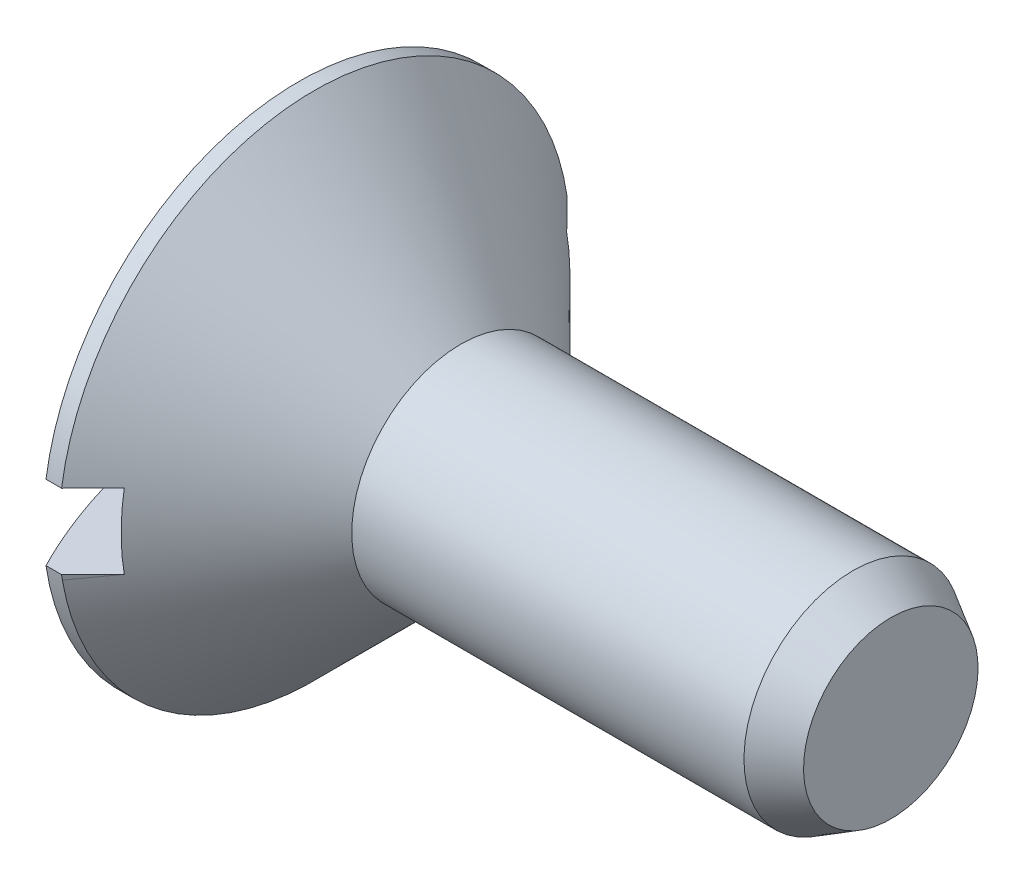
from build123d import *

# Parameters (mm, degrees)
CUT_EXTRUDE1_DEPTH      = 12.129690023
CUT_EXTRUDE1_DEPTH_BACK = 12.129690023
SKETCH2_W               = 1.75
SKETCH2_H               = 1.2
CHAMFER1_SIZE           = 0.35
CHAMFER1_SIZE2          = 0.606217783


with BuildPart() as part:
    # Sketch1 → Revolve1 (revolve)
    with BuildSketch(Plane.XY):
        with BuildLine():
            Line((0, 4.1), (0.25, 4.1))
            Line((0.25, 4.1), (2.6, 1.75))
            Line((2.6, 1.75), (9.5, 1.75))
            Line((9.5, 1.75), (9.5, 0))
            Line((9.5, 0), (0, 0))
            Line((0, 0), (-1, 0))
            ThreePointArc((-1, 0), (-0.746388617, 2.110094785), (0, 4.1))
        make_face()
    revolve(axis=Axis((6.620684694, 0, 0), (-1, 0, 0)))

    # Sketch2 → Cut-Extrude1 (cut, two sides: drawn at the far end of the back side and taken through both)
    with BuildSketch(Plane.XY.offset(-CUT_EXTRUDE1_DEPTH_BACK)):
        with Locations((-0.125, 0)):
            Rectangle(SKETCH2_W, SKETCH2_H)
    extrude(amount=CUT_EXTRUDE1_DEPTH + CUT_EXTRUDE1_DEPTH_BACK, mode=Mode.SUBTRACT)

    # Chamfer1
    chamfer1_edges = [part.edges().sort_by_distance(p)[0] for p in [
        (9.5, -1.75, 0),
    ]]
    chamfer1_side = [part.faces().sort_by_distance(p)[0] for p in [
        (9.5, 0, 0),
    ]]
    chamfer(chamfer1_edges, length=CHAMFER1_SIZE, length2=CHAMFER1_SIZE2, reference=chamfer1_side[0])


solid = part.part
